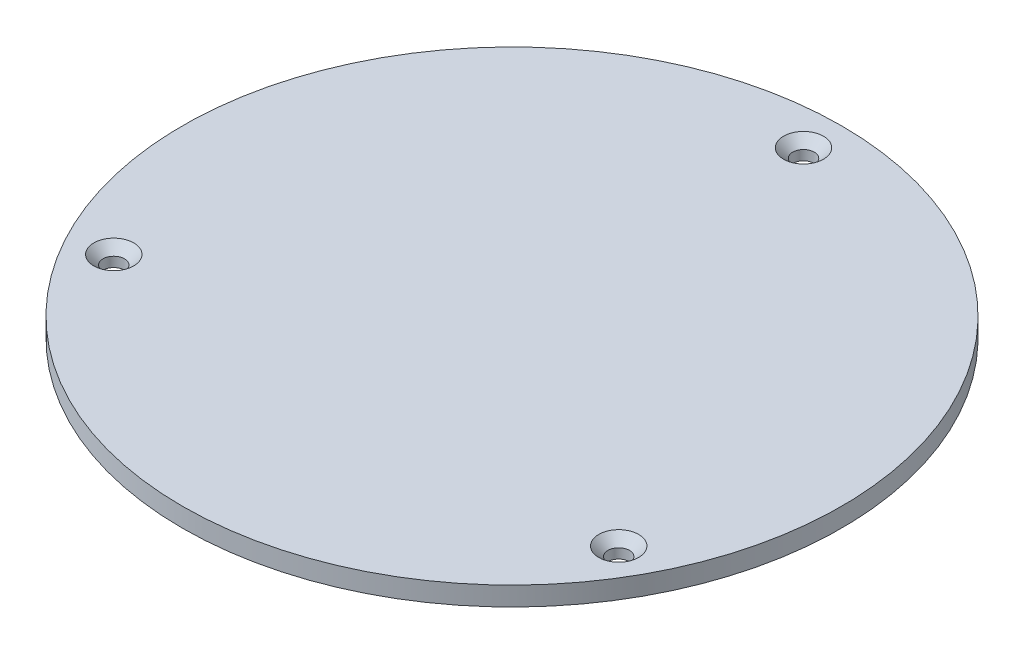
from build123d import *

# Parameters (mm, degrees)
ESQUISSE1_R                  = 52
BOSS_EXTRU_1_DEPTH           = 3
R_P_TITION_CIRCULAIRE1_COUNT = 3


with BuildPart() as part:
    # Esquisse1 → Boss.-Extru.1 (new body)
    with BuildSketch(Plane(origin=(0, 0, 0), x_dir=(1, 0, 0), z_dir=(0, 1, 0))):
        with Locations(Location((0, 0, 0), (0, 0, 270))):
            Circle(ESQUISSE1_R)
    extrude(amount=BOSS_EXTRU_1_DEPTH)

    # Esquisse3 → Fraisage pour vis _ t_te frais_e M31 (revolve, cut)
    with BuildSketch(Plane(origin=(0, 3, -46), x_dir=(0, 0, 1), z_dir=(1, 0, 0))):
        Polygon((0, 0), (0, 3), (1.7, 3), (1.7, 1.45), (3.15, 0), align=None)
    fraisage_pour_vis_t_te_frais_e_m31 = revolve(axis=Axis((0, 9.35, -46), (0, -1, 0)), mode=Mode.SUBTRACT)

    # R_p_tition circulaire1: Fraisage pour vis _ t_te frais_e M31 ×3 about axis
    r_p_tition_circulaire1_axis = Axis((0, 0, 0), (0, 1, 0))
    for i in range(1, R_P_TITION_CIRCULAIRE1_COUNT):
        add(fraisage_pour_vis_t_te_frais_e_m31.rotate(r_p_tition_circulaire1_axis, i * 360 / R_P_TITION_CIRCULAIRE1_COUNT), mode=Mode.SUBTRACT)


solid = part.part
